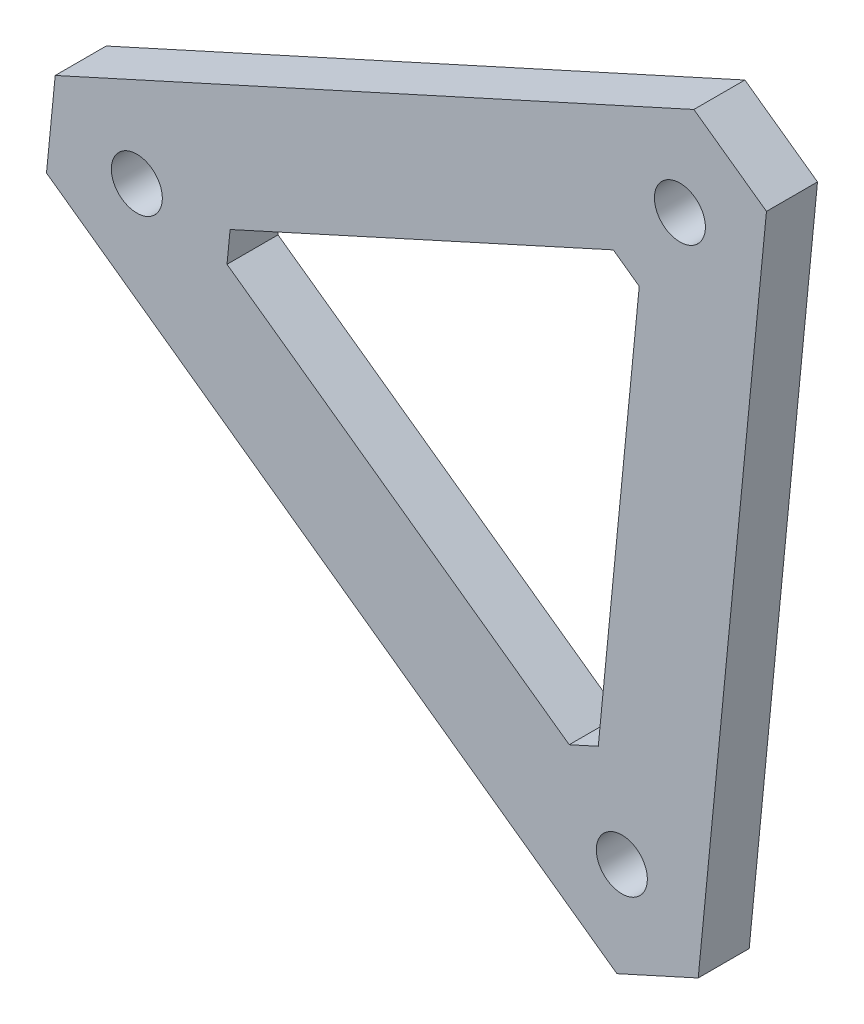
from build123d import *

# Parameters (mm, degrees)
SKETCH1_R      = 12.7
EXTRUDE1_DEPTH = 25.4


with BuildPart() as part:
    # Sketch1 → Extrude1 (new body)
    with BuildSketch(Plane.XY):
        Polygon((-44.980643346, -17.930846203), (239.040212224, -221.173843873), (279.515997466, -202.802308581), (313.519168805, 144.788466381), (277.371059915, 170.655756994), (-40.652966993, 26.307979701), align=None)
        Circle(SKETCH1_R, mode=Mode.SUBTRACT)
        with Locations((270.409306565, 122.735954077)):
            Circle(SKETCH1_R, mode=Mode.SUBTRACT)
        with Locations((241.497107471, -172.813351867)):
            Circle(SKETCH1_R, mode=Mode.SUBTRACT)
        Polygon((44.892749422, -12.367036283), (215.305262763, -134.312834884), (229.76090035, -127.75157228), (250.162803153, 80.802892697), (237.252764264, 90.041210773), (46.438348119, 3.432544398), align=None, mode=Mode.SUBTRACT)
    extrude(amount=-EXTRUDE1_DEPTH)


solid = part.part
